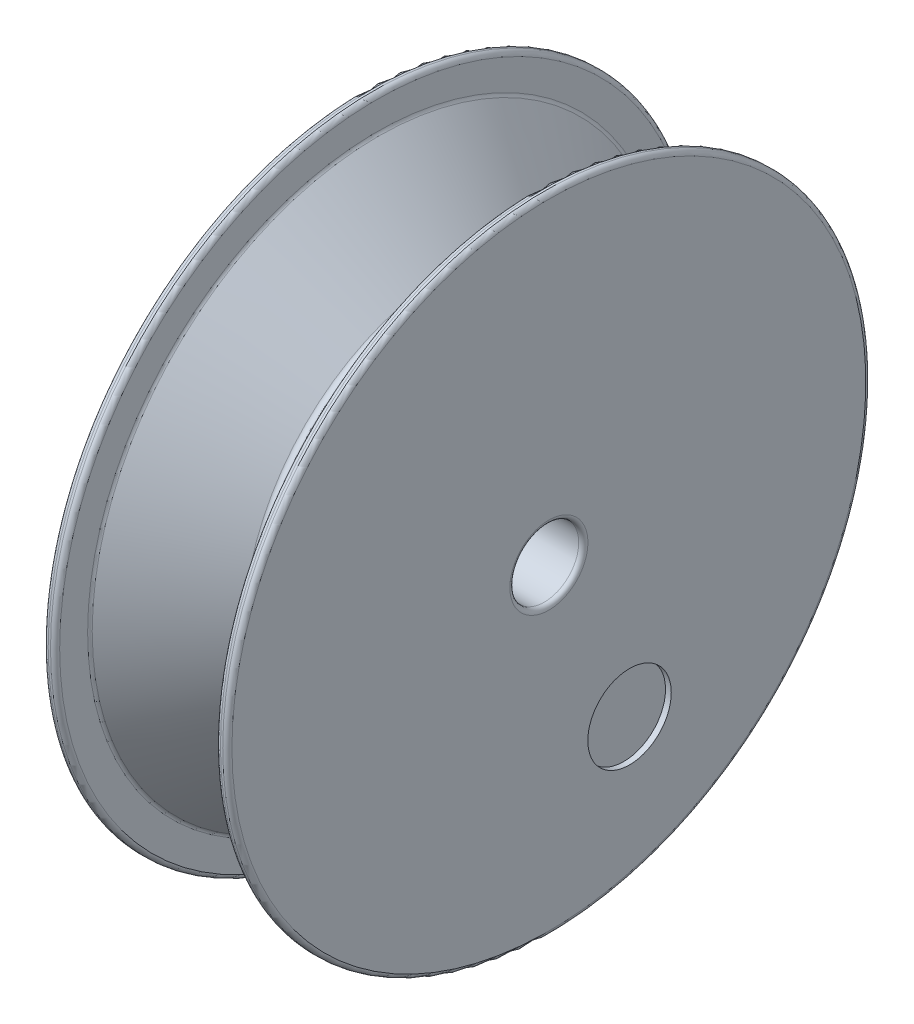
from build123d import *

# Parameters (mm, degrees)
CONG_1_R                = 0.2
ESQUISSE2_R             = 1.817280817
ENL_V_MAT_EXTRU_1_DEPTH = 0.25


with BuildPart() as part:
    # Esquisse1 → R_volution2 (revolve)
    with BuildSketch(Plane.XY, mode=Mode.PRIVATE) as r_volution2_sk:
        Polygon((-3.5, 12.5), (0, 9), (3.5, 12.5), (3.5, 14), (4, 14), (4, 1.5), (-4, 1.5), (-4, 14), (-3.5, 14), align=None)
    revolve(r_volution2_sk.sketch.rotate(Axis((0, 0, 0), (1, 0, 0)), 90), axis=Axis((0, 0, 0), (1, 0, 0)))

    # Cong_1
    cong_1_edges = [part.edges().sort_by_distance(p)[0] for p in [
        (-4, 0, -1.5),
        (4, 0, -1.5),
        (4, 0, -14),
        (3.5, 0, -14),
        (3.5, 0, -12.5),
        (0, 0, -9),
        (-3.5, 0, -12.5),
        (-3.5, 0, -14),
        (-4, 0, -14),
    ]]
    fillet(cong_1_edges, radius=CONG_1_R)

    # Esquisse2 → Enl_v. mat.-Extru.1 (cut)
    with BuildSketch(Plane(origin=(4, 0, 0), x_dir=(0, 0, -1), z_dir=(1, 0, 0))):
        with Locations((3.511925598, -7.472568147)):
            Circle(ESQUISSE2_R)
    extrude(amount=-ENL_V_MAT_EXTRU_1_DEPTH, mode=Mode.SUBTRACT)


solid = part.part
